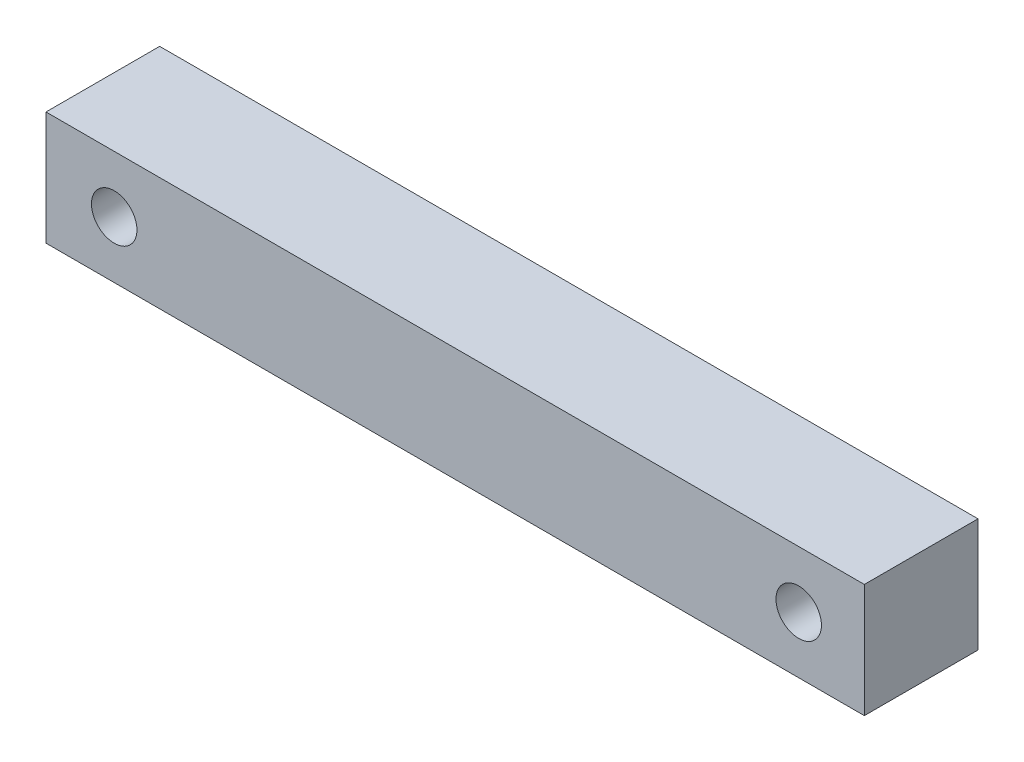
ISO-10303-21;
HEADER;
FILE_DESCRIPTION(('STEP AP214'),'2;1');
FILE_NAME('part.step','',(''),(''),'','','');
FILE_SCHEMA(('AUTOMOTIVE_DESIGN { 1 0 10303 214 1 1 1 1 }'));
ENDSEC;
DATA;
#1=APPLICATION_CONTEXT('core data for automotive mechanical design processes');
#2=APPLICATION_PROTOCOL_DEFINITION('international standard','automotive_design',2000,#1);
#3=PRODUCT_CONTEXT('',#1,'mechanical');
#4=PRODUCT('Part','Part','',(#3));
#5=PRODUCT_RELATED_PRODUCT_CATEGORY('part','',(#4));
#6=PRODUCT_DEFINITION_FORMATION('','',#4);
#7=PRODUCT_DEFINITION_CONTEXT('part definition',#1,'design');
#8=PRODUCT_DEFINITION('design','',#6,#7);
#9=PRODUCT_DEFINITION_SHAPE('','',#8);
#10=(LENGTH_UNIT() NAMED_UNIT(*) SI_UNIT(.MILLI.,.METRE.));
#11=(NAMED_UNIT(*) PLANE_ANGLE_UNIT() SI_UNIT($,.RADIAN.));
#12=(NAMED_UNIT(*) SI_UNIT($,.STERADIAN.) SOLID_ANGLE_UNIT());
#13=UNCERTAINTY_MEASURE_WITH_UNIT(LENGTH_MEASURE(1.E-05),#10,'distance_accuracy_value','');
#14=(GEOMETRIC_REPRESENTATION_CONTEXT(3) GLOBAL_UNCERTAINTY_ASSIGNED_CONTEXT((#13)) GLOBAL_UNIT_ASSIGNED_CONTEXT((#10,
#11,#12)) REPRESENTATION_CONTEXT('',''));
#15=CARTESIAN_POINT('',(0.,0.,0.));
#16=DIRECTION('',(0.,0.,1.));
#17=DIRECTION('',(1.,0.,0.));
#18=AXIS2_PLACEMENT_3D('',#15,#16,#17);
#19=CARTESIAN_POINT('',(-18.,2.5,5.));
#20=DIRECTION('',(1.,0.,0.));
#21=DIRECTION('',(0.,0.,-1.));
#22=AXIS2_PLACEMENT_3D('',#19,#20,#21);
#23=PLANE('',#22);
#24=DIRECTION('',(0.,-1.,0.));
#25=VECTOR('',#24,1.);
#26=CARTESIAN_POINT('',(-18.,2.5,0.));
#27=LINE('',#26,#25);
#28=CARTESIAN_POINT('',(-18.,2.5,0.));
#29=VERTEX_POINT('',#28);
#30=CARTESIAN_POINT('',(-18.,-2.5,0.));
#31=VERTEX_POINT('',#30);
#32=EDGE_CURVE('E98',#29,#31,#27,.T.);
#33=ORIENTED_EDGE('',*,*,#32,.T.);
#34=DIRECTION('',(0.,0.,-1.));
#35=VECTOR('',#34,1.);
#36=CARTESIAN_POINT('',(-18.,-2.5,5.));
#37=LINE('',#36,#35);
#38=CARTESIAN_POINT('',(-18.,-2.5,5.));
#39=VERTEX_POINT('',#38);
#40=EDGE_CURVE('E11',#39,#31,#37,.T.);
#41=ORIENTED_EDGE('',*,*,#40,.F.);
#42=DIRECTION('',(0.,-1.,0.));
#43=VECTOR('',#42,1.);
#44=CARTESIAN_POINT('',(-18.,2.5,5.));
#45=LINE('',#44,#43);
#46=CARTESIAN_POINT('',(-18.,2.5,5.));
#47=VERTEX_POINT('',#46);
#48=EDGE_CURVE('E86',#47,#39,#45,.T.);
#49=ORIENTED_EDGE('',*,*,#48,.F.);
#50=DIRECTION('',(0.,0.,-1.));
#51=VECTOR('',#50,1.);
#52=CARTESIAN_POINT('',(-18.,2.5,5.));
#53=LINE('',#52,#51);
#54=EDGE_CURVE('E94',#47,#29,#53,.T.);
#55=ORIENTED_EDGE('',*,*,#54,.T.);
#56=EDGE_LOOP('',(#33,#41,#49,#55));
#57=FACE_BOUND('',#56,.T.);
#58=ADVANCED_FACE('F35',(#57),#23,.F.);
#59=CARTESIAN_POINT('',(-18.,-2.5,5.));
#60=DIRECTION('',(0.,1.,0.));
#61=DIRECTION('',(0.,0.,1.));
#62=AXIS2_PLACEMENT_3D('',#59,#60,#61);
#63=PLANE('',#62);
#64=DIRECTION('',(1.,0.,0.));
#65=VECTOR('',#64,1.);
#66=CARTESIAN_POINT('',(-18.,-2.5,0.));
#67=LINE('',#66,#65);
#68=CARTESIAN_POINT('',(18.,-2.5,0.));
#69=VERTEX_POINT('',#68);
#70=EDGE_CURVE('E90',#31,#69,#67,.T.);
#71=ORIENTED_EDGE('',*,*,#70,.T.);
#72=DIRECTION('',(0.,0.,-1.));
#73=VECTOR('',#72,1.);
#74=CARTESIAN_POINT('',(18.,-2.5,5.));
#75=LINE('',#74,#73);
#76=CARTESIAN_POINT('',(18.,-2.5,5.));
#77=VERTEX_POINT('',#76);
#78=EDGE_CURVE('E43',#77,#69,#75,.T.);
#79=ORIENTED_EDGE('',*,*,#78,.F.);
#80=DIRECTION('',(1.,0.,0.));
#81=VECTOR('',#80,1.);
#82=CARTESIAN_POINT('',(-18.,-2.5,5.));
#83=LINE('',#82,#81);
#84=EDGE_CURVE('E81',#39,#77,#83,.T.);
#85=ORIENTED_EDGE('',*,*,#84,.F.);
#86=ORIENTED_EDGE('',*,*,#40,.T.);
#87=EDGE_LOOP('',(#71,#79,#85,#86));
#88=FACE_BOUND('',#87,.T.);
#89=ADVANCED_FACE('F89',(#88),#63,.F.);
#90=CARTESIAN_POINT('',(18.,2.5,5.));
#91=DIRECTION('',(-1.,0.,0.));
#92=DIRECTION('',(0.,0.,1.));
#93=AXIS2_PLACEMENT_3D('',#90,#91,#92);
#94=PLANE('',#93);
#95=DIRECTION('',(0.,1.,0.));
#96=VECTOR('',#95,1.);
#97=CARTESIAN_POINT('',(18.,2.5,0.));
#98=LINE('',#97,#96);
#99=CARTESIAN_POINT('',(18.,2.5,0.));
#100=VERTEX_POINT('',#99);
#101=EDGE_CURVE('E68',#69,#100,#98,.T.);
#102=ORIENTED_EDGE('',*,*,#101,.T.);
#103=DIRECTION('',(0.,0.,-1.));
#104=VECTOR('',#103,1.);
#105=CARTESIAN_POINT('',(18.,2.5,5.));
#106=LINE('',#105,#104);
#107=CARTESIAN_POINT('',(18.,2.5,5.));
#108=VERTEX_POINT('',#107);
#109=EDGE_CURVE('E91',#108,#100,#106,.T.);
#110=ORIENTED_EDGE('',*,*,#109,.F.);
#111=DIRECTION('',(0.,1.,0.));
#112=VECTOR('',#111,1.);
#113=CARTESIAN_POINT('',(18.,2.5,5.));
#114=LINE('',#113,#112);
#115=EDGE_CURVE('E84',#77,#108,#114,.T.);
#116=ORIENTED_EDGE('',*,*,#115,.F.);
#117=ORIENTED_EDGE('',*,*,#78,.T.);
#118=EDGE_LOOP('',(#102,#110,#116,#117));
#119=FACE_BOUND('',#118,.T.);
#120=ADVANCED_FACE('F92',(#119),#94,.F.);
#121=CARTESIAN_POINT('',(-18.,2.5,5.));
#122=DIRECTION('',(0.,-1.,0.));
#123=DIRECTION('',(0.,0.,-1.));
#124=AXIS2_PLACEMENT_3D('',#121,#122,#123);
#125=PLANE('',#124);
#126=DIRECTION('',(-1.,0.,0.));
#127=VECTOR('',#126,1.);
#128=CARTESIAN_POINT('',(-18.,2.5,0.));
#129=LINE('',#128,#127);
#130=EDGE_CURVE('E74',#100,#29,#129,.T.);
#131=ORIENTED_EDGE('',*,*,#130,.T.);
#132=ORIENTED_EDGE('',*,*,#54,.F.);
#133=DIRECTION('',(-1.,0.,0.));
#134=VECTOR('',#133,1.);
#135=CARTESIAN_POINT('',(-18.,2.5,5.));
#136=LINE('',#135,#134);
#137=EDGE_CURVE('E51',#108,#47,#136,.T.);
#138=ORIENTED_EDGE('',*,*,#137,.F.);
#139=ORIENTED_EDGE('',*,*,#109,.T.);
#140=EDGE_LOOP('',(#131,#132,#138,#139));
#141=FACE_BOUND('',#140,.T.);
#142=ADVANCED_FACE('F106',(#141),#125,.F.);
#143=CARTESIAN_POINT('',(0.,0.,5.));
#144=DIRECTION('',(0.,0.,1.));
#145=DIRECTION('',(1.,0.,0.));
#146=AXIS2_PLACEMENT_3D('',#143,#144,#145);
#147=PLANE('',#146);
#148=CARTESIAN_POINT('',(15.112,0.,5.));
#149=DIRECTION('',(0.,0.,1.));
#150=DIRECTION('',(1.,0.,0.));
#151=AXIS2_PLACEMENT_3D('',#148,#149,#150);
#152=CIRCLE('',#151,1.00000000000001);
#153=CARTESIAN_POINT('',(16.112,0.,5.));
#154=VERTEX_POINT('',#153);
#155=EDGE_CURVE('E118',#154,#154,#152,.T.);
#156=ORIENTED_EDGE('',*,*,#155,.F.);
#157=EDGE_LOOP('',(#156));
#158=FACE_BOUND('',#157,.T.);
#159=CARTESIAN_POINT('',(-15.,0.,5.));
#160=DIRECTION('',(0.,0.,1.));
#161=DIRECTION('',(1.,0.,0.));
#162=AXIS2_PLACEMENT_3D('',#159,#160,#161);
#163=CIRCLE('',#162,1.);
#164=CARTESIAN_POINT('',(-14.,0.,5.));
#165=VERTEX_POINT('',#164);
#166=EDGE_CURVE('E112',#165,#165,#163,.T.);
#167=ORIENTED_EDGE('',*,*,#166,.F.);
#168=EDGE_LOOP('',(#167));
#169=FACE_BOUND('',#168,.T.);
#170=ORIENTED_EDGE('',*,*,#48,.T.);
#171=ORIENTED_EDGE('',*,*,#84,.T.);
#172=ORIENTED_EDGE('',*,*,#115,.T.);
#173=ORIENTED_EDGE('',*,*,#137,.T.);
#174=EDGE_LOOP('',(#170,#171,#172,#173));
#175=FACE_BOUND('',#174,.T.);
#176=ADVANCED_FACE('F82',(#158,#169,#175),#147,.T.);
#177=CARTESIAN_POINT('',(0.,0.,0.));
#178=DIRECTION('',(0.,0.,1.));
#179=DIRECTION('',(1.,0.,0.));
#180=AXIS2_PLACEMENT_3D('',#177,#178,#179);
#181=PLANE('',#180);
#182=CARTESIAN_POINT('',(15.112,0.,0.));
#183=DIRECTION('',(0.,0.,1.));
#184=DIRECTION('',(1.,0.,0.));
#185=AXIS2_PLACEMENT_3D('',#182,#183,#184);
#186=CIRCLE('',#185,1.00000000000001);
#187=CARTESIAN_POINT('',(16.112,0.,0.));
#188=VERTEX_POINT('',#187);
#189=EDGE_CURVE('E115',#188,#188,#186,.T.);
#190=ORIENTED_EDGE('',*,*,#189,.T.);
#191=EDGE_LOOP('',(#190));
#192=FACE_BOUND('',#191,.T.);
#193=CARTESIAN_POINT('',(-15.,0.,0.));
#194=DIRECTION('',(0.,0.,1.));
#195=DIRECTION('',(1.,0.,0.));
#196=AXIS2_PLACEMENT_3D('',#193,#194,#195);
#197=CIRCLE('',#196,1.);
#198=CARTESIAN_POINT('',(-14.,0.,0.));
#199=VERTEX_POINT('',#198);
#200=EDGE_CURVE('E101',#199,#199,#197,.T.);
#201=ORIENTED_EDGE('',*,*,#200,.T.);
#202=EDGE_LOOP('',(#201));
#203=FACE_BOUND('',#202,.T.);
#204=ORIENTED_EDGE('',*,*,#32,.F.);
#205=ORIENTED_EDGE('',*,*,#130,.F.);
#206=ORIENTED_EDGE('',*,*,#101,.F.);
#207=ORIENTED_EDGE('',*,*,#70,.F.);
#208=EDGE_LOOP('',(#204,#205,#206,#207));
#209=FACE_BOUND('',#208,.T.);
#210=ADVANCED_FACE('F109',(#192,#203,#209),#181,.F.);
#211=CARTESIAN_POINT('',(-15.,0.,0.));
#212=DIRECTION('',(0.,0.,1.));
#213=DIRECTION('',(1.,0.,0.));
#214=AXIS2_PLACEMENT_3D('',#211,#212,#213);
#215=CYLINDRICAL_SURFACE('',#214,1.);
#216=ORIENTED_EDGE('',*,*,#200,.F.);
#217=EDGE_LOOP('',(#216));
#218=FACE_BOUND('',#217,.T.);
#219=ORIENTED_EDGE('',*,*,#166,.T.);
#220=EDGE_LOOP('',(#219));
#221=FACE_BOUND('',#220,.T.);
#222=ADVANCED_FACE('F129',(#218,#221),#215,.F.);
#223=CARTESIAN_POINT('',(15.112,0.,0.));
#224=DIRECTION('',(0.,0.,1.));
#225=DIRECTION('',(1.,0.,0.));
#226=AXIS2_PLACEMENT_3D('',#223,#224,#225);
#227=CYLINDRICAL_SURFACE('',#226,1.00000000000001);
#228=ORIENTED_EDGE('',*,*,#189,.F.);
#229=EDGE_LOOP('',(#228));
#230=FACE_BOUND('',#229,.T.);
#231=ORIENTED_EDGE('',*,*,#155,.T.);
#232=EDGE_LOOP('',(#231));
#233=FACE_BOUND('',#232,.T.);
#234=ADVANCED_FACE('F126',(#230,#233),#227,.F.);
#235=CLOSED_SHELL('',(#58,#89,#120,#142,#176,#210,#222,#234));
#236=MANIFOLD_SOLID_BREP('B2',#235);
#237=ADVANCED_BREP_SHAPE_REPRESENTATION('',(#18,#236),#14);
#238=SHAPE_DEFINITION_REPRESENTATION(#9,#237);
ENDSEC;
END-ISO-10303-21;
